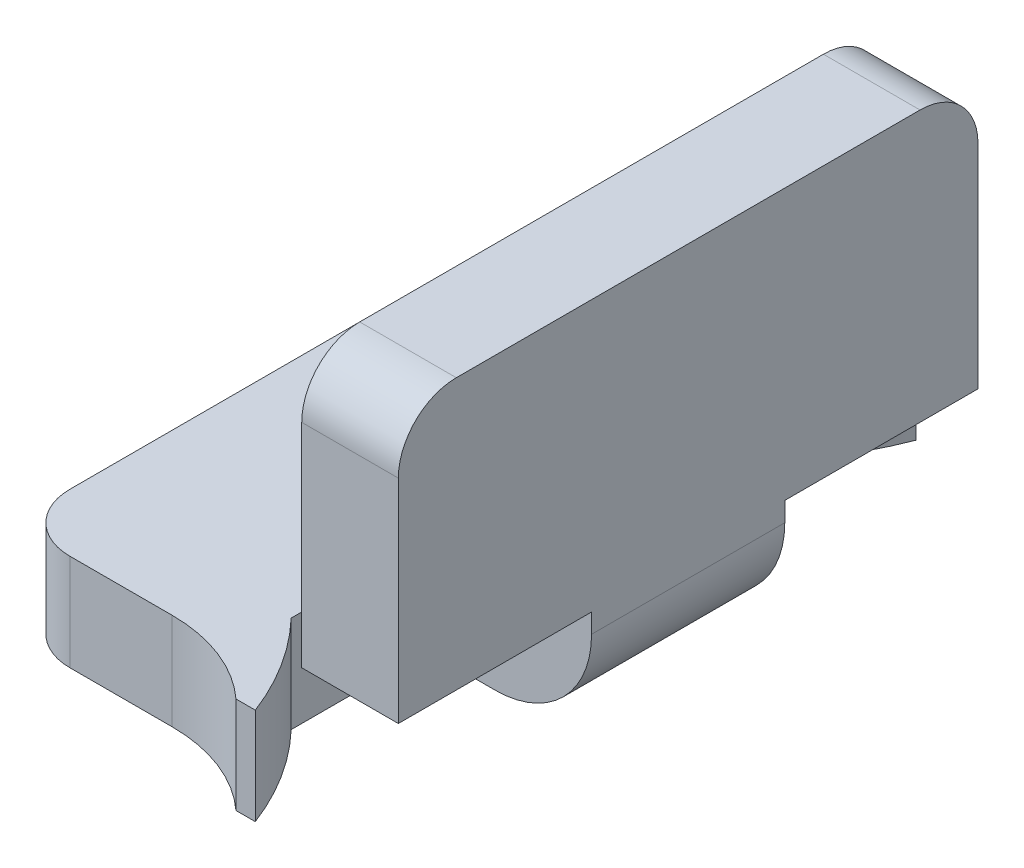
ISO-10303-21;
HEADER;
FILE_DESCRIPTION(('STEP AP214'),'2;1');
FILE_NAME('part.step','',(''),(''),'','','');
FILE_SCHEMA(('AUTOMOTIVE_DESIGN { 1 0 10303 214 1 1 1 1 }'));
ENDSEC;
DATA;
#1=APPLICATION_CONTEXT('core data for automotive mechanical design processes');
#2=APPLICATION_PROTOCOL_DEFINITION('international standard','automotive_design',2000,#1);
#3=PRODUCT_CONTEXT('',#1,'mechanical');
#4=PRODUCT('Part','Part','',(#3));
#5=PRODUCT_RELATED_PRODUCT_CATEGORY('part','',(#4));
#6=PRODUCT_DEFINITION_FORMATION('','',#4);
#7=PRODUCT_DEFINITION_CONTEXT('part definition',#1,'design');
#8=PRODUCT_DEFINITION('design','',#6,#7);
#9=PRODUCT_DEFINITION_SHAPE('','',#8);
#10=(LENGTH_UNIT() NAMED_UNIT(*) SI_UNIT(.MILLI.,.METRE.));
#11=(NAMED_UNIT(*) PLANE_ANGLE_UNIT() SI_UNIT($,.RADIAN.));
#12=(NAMED_UNIT(*) SI_UNIT($,.STERADIAN.) SOLID_ANGLE_UNIT());
#13=UNCERTAINTY_MEASURE_WITH_UNIT(LENGTH_MEASURE(1.E-05),#10,'distance_accuracy_value','');
#14=(GEOMETRIC_REPRESENTATION_CONTEXT(3) GLOBAL_UNCERTAINTY_ASSIGNED_CONTEXT((#13)) GLOBAL_UNIT_ASSIGNED_CONTEXT((#10,
#11,#12)) REPRESENTATION_CONTEXT('',''));
#15=CARTESIAN_POINT('',(0.,0.,0.));
#16=DIRECTION('',(0.,0.,1.));
#17=DIRECTION('',(1.,0.,0.));
#18=AXIS2_PLACEMENT_3D('',#15,#16,#17);
#19=CARTESIAN_POINT('',(-2.,0.5,1.5));
#20=DIRECTION('',(0.,-1.,0.));
#21=DIRECTION('',(1.,0.,0.));
#22=AXIS2_PLACEMENT_3D('',#19,#20,#21);
#23=PLANE('',#22);
#24=DIRECTION('',(1.,0.,0.));
#25=VECTOR('',#24,1.);
#26=CARTESIAN_POINT('',(-2.,0.5,-1.70998661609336));
#27=LINE('',#26,#25);
#28=CARTESIAN_POINT('',(-0.630209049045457,0.5,-1.70998661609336));
#29=VERTEX_POINT('',#28);
#30=CARTESIAN_POINT('',(-0.530209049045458,0.5,-1.70998661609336));
#31=VERTEX_POINT('',#30);
#32=EDGE_CURVE('E435',#29,#31,#27,.T.);
#33=ORIENTED_EDGE('',*,*,#32,.F.);
#34=CARTESIAN_POINT('',(-1.17047213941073,0.5,-2.3));
#35=DIRECTION('',(0.,1.,0.));
#36=DIRECTION('',(-1.,0.,0.));
#37=AXIS2_PLACEMENT_3D('',#34,#35,#36);
#38=CIRCLE('',#37,0.8);
#39=CARTESIAN_POINT('',(-1.17047213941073,0.5,-1.5));
#40=VERTEX_POINT('',#39);
#41=EDGE_CURVE('E436',#40,#29,#38,.T.);
#42=ORIENTED_EDGE('',*,*,#41,.F.);
#43=DIRECTION('',(-1.,0.,0.));
#44=VECTOR('',#43,1.);
#45=CARTESIAN_POINT('',(-0.6,0.5,-1.5));
#46=LINE('',#45,#44);
#47=CARTESIAN_POINT('',(-1.7,0.5,-1.5));
#48=VERTEX_POINT('',#47);
#49=EDGE_CURVE('E395',#48,#40,#46,.F.);
#50=ORIENTED_EDGE('',*,*,#49,.F.);
#51=CARTESIAN_POINT('',(-1.7,0.499999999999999,-1.2));
#52=DIRECTION('',(0.,1.,0.));
#53=DIRECTION('',(-1.,0.,0.));
#54=AXIS2_PLACEMENT_3D('',#51,#52,#53);
#55=CIRCLE('',#54,0.3);
#56=CARTESIAN_POINT('',(-2.,0.5,-1.2));
#57=VERTEX_POINT('',#56);
#58=EDGE_CURVE('E394',#57,#48,#55,.F.);
#59=ORIENTED_EDGE('',*,*,#58,.F.);
#60=DIRECTION('',(0.,0.,1.));
#61=VECTOR('',#60,1.);
#62=CARTESIAN_POINT('',(-2.,0.5,1.5));
#63=LINE('',#62,#61);
#64=CARTESIAN_POINT('',(-2.,0.500000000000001,1.2));
#65=VERTEX_POINT('',#64);
#66=EDGE_CURVE('E388',#57,#65,#63,.T.);
#67=ORIENTED_EDGE('',*,*,#66,.T.);
#68=CARTESIAN_POINT('',(-1.7,0.5,1.2));
#69=DIRECTION('',(0.,-1.,0.));
#70=DIRECTION('',(1.,0.,0.));
#71=AXIS2_PLACEMENT_3D('',#68,#69,#70);
#72=CIRCLE('',#71,0.3);
#73=CARTESIAN_POINT('',(-1.7,0.5,1.5));
#74=VERTEX_POINT('',#73);
#75=EDGE_CURVE('E439',#74,#65,#72,.T.);
#76=ORIENTED_EDGE('',*,*,#75,.F.);
#77=DIRECTION('',(1.,0.,0.));
#78=VECTOR('',#77,1.);
#79=CARTESIAN_POINT('',(-2.,0.5,1.5));
#80=LINE('',#79,#78);
#81=CARTESIAN_POINT('',(-1.17047213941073,0.5,1.5));
#82=VERTEX_POINT('',#81);
#83=EDGE_CURVE('E440',#82,#74,#80,.F.);
#84=ORIENTED_EDGE('',*,*,#83,.F.);
#85=CARTESIAN_POINT('',(-1.17047213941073,0.5,2.3));
#86=DIRECTION('',(0.,1.,0.));
#87=DIRECTION('',(-1.,0.,0.));
#88=AXIS2_PLACEMENT_3D('',#85,#86,#87);
#89=CIRCLE('',#88,0.8);
#90=CARTESIAN_POINT('',(-0.630209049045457,0.5,1.70998661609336));
#91=VERTEX_POINT('',#90);
#92=EDGE_CURVE('E441',#91,#82,#89,.T.);
#93=ORIENTED_EDGE('',*,*,#92,.F.);
#94=DIRECTION('',(1.,0.,0.));
#95=VECTOR('',#94,1.);
#96=CARTESIAN_POINT('',(-2.,0.5,1.70998661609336));
#97=LINE('',#96,#95);
#98=CARTESIAN_POINT('',(-0.530209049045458,0.5,1.70998661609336));
#99=VERTEX_POINT('',#98);
#100=EDGE_CURVE('E443',#99,#91,#97,.F.);
#101=ORIENTED_EDGE('',*,*,#100,.F.);
#102=CARTESIAN_POINT('',(-1.9321720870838,0.5,2.2433716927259));
#103=DIRECTION('',(0.,1.,0.));
#104=DIRECTION('',(-1.,0.,0.));
#105=AXIS2_PLACEMENT_3D('',#102,#103,#104);
#106=CIRCLE('',#105,1.5);
#107=CARTESIAN_POINT('',(-0.85,0.5,1.2046688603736));
#108=VERTEX_POINT('',#107);
#109=EDGE_CURVE('E21',#108,#99,#106,.F.);
#110=ORIENTED_EDGE('',*,*,#109,.F.);
#111=DIRECTION('',(0.,0.,1.));
#112=VECTOR('',#111,1.);
#113=CARTESIAN_POINT('',(-0.85,0.5,1.5));
#114=LINE('',#113,#112);
#115=CARTESIAN_POINT('',(-0.85,0.5,0.857037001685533));
#116=VERTEX_POINT('',#115);
#117=EDGE_CURVE('E169',#116,#108,#114,.T.);
#118=ORIENTED_EDGE('',*,*,#117,.F.);
#119=DIRECTION('',(-0.573576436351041,0.,0.819152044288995));
#120=VECTOR('',#119,1.);
#121=CARTESIAN_POINT('',(-0.6,0.5,0.5));
#122=LINE('',#121,#120);
#123=CARTESIAN_POINT('',(-0.6,0.5,0.5));
#124=VERTEX_POINT('',#123);
#125=EDGE_CURVE('E401',#124,#116,#122,.T.);
#126=ORIENTED_EDGE('',*,*,#125,.F.);
#127=DIRECTION('',(0.,0.,1.));
#128=VECTOR('',#127,1.);
#129=CARTESIAN_POINT('',(-0.6,0.5,1.5));
#130=LINE('',#129,#128);
#131=CARTESIAN_POINT('',(-0.6,0.5,-0.5));
#132=VERTEX_POINT('',#131);
#133=EDGE_CURVE('E181',#132,#124,#130,.T.);
#134=ORIENTED_EDGE('',*,*,#133,.F.);
#135=DIRECTION('',(0.573576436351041,0.,0.819152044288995));
#136=VECTOR('',#135,1.);
#137=CARTESIAN_POINT('',(-0.85,0.5,-0.857037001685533));
#138=LINE('',#137,#136);
#139=CARTESIAN_POINT('',(-0.85,0.5,-0.857037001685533));
#140=VERTEX_POINT('',#139);
#141=EDGE_CURVE('E175',#140,#132,#138,.T.);
#142=ORIENTED_EDGE('',*,*,#141,.F.);
#143=DIRECTION('',(0.,0.,1.));
#144=VECTOR('',#143,1.);
#145=CARTESIAN_POINT('',(-0.85,0.5,1.5));
#146=LINE('',#145,#144);
#147=CARTESIAN_POINT('',(-0.85,0.5,-1.2046688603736));
#148=VERTEX_POINT('',#147);
#149=EDGE_CURVE('E178',#148,#140,#146,.T.);
#150=ORIENTED_EDGE('',*,*,#149,.F.);
#151=CARTESIAN_POINT('',(-1.9321720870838,0.5,-2.2433716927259));
#152=DIRECTION('',(0.,1.,0.));
#153=DIRECTION('',(-1.,0.,0.));
#154=AXIS2_PLACEMENT_3D('',#151,#152,#153);
#155=CIRCLE('',#154,1.5);
#156=EDGE_CURVE('E398',#31,#148,#155,.F.);
#157=ORIENTED_EDGE('',*,*,#156,.F.);
#158=EDGE_LOOP('',(#33,#42,#50,#59,#67,#76,#84,#93,#101,#110,#118,#126,#134,#142,#150,#157));
#159=FACE_BOUND('',#158,.T.);
#160=ADVANCED_FACE('F17',(#159),#23,.F.);
#161=CARTESIAN_POINT('',(-0.6,0.6,-1.5));
#162=DIRECTION('',(0.,0.,-1.));
#163=DIRECTION('',(-1.,0.,0.));
#164=AXIS2_PLACEMENT_3D('',#161,#162,#163);
#165=PLANE('',#164);
#166=ORIENTED_EDGE('',*,*,#49,.T.);
#167=DIRECTION('',(0.,1.,0.));
#168=VECTOR('',#167,1.);
#169=CARTESIAN_POINT('',(-1.17047213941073,-0.81683038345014,-1.5));
#170=LINE('',#169,#168);
#171=CARTESIAN_POINT('',(-1.17047213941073,0.,-1.5));
#172=VERTEX_POINT('',#171);
#173=EDGE_CURVE('E362',#40,#172,#170,.F.);
#174=ORIENTED_EDGE('',*,*,#173,.T.);
#175=DIRECTION('',(1.,0.,0.));
#176=VECTOR('',#175,1.);
#177=CARTESIAN_POINT('',(-2.,0.,-1.5));
#178=LINE('',#177,#176);
#179=CARTESIAN_POINT('',(-1.7,0.,-1.5));
#180=VERTEX_POINT('',#179);
#181=EDGE_CURVE('E195',#172,#180,#178,.F.);
#182=ORIENTED_EDGE('',*,*,#181,.T.);
#183=DIRECTION('',(0.,1.,0.));
#184=VECTOR('',#183,1.);
#185=CARTESIAN_POINT('',(-1.7,0.499999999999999,-1.5));
#186=LINE('',#185,#184);
#187=EDGE_CURVE('E392',#48,#180,#186,.F.);
#188=ORIENTED_EDGE('',*,*,#187,.F.);
#189=EDGE_LOOP('',(#166,#174,#182,#188));
#190=FACE_BOUND('',#189,.T.);
#191=ADVANCED_FACE('F659',(#190),#165,.T.);
#192=CARTESIAN_POINT('',(-1.7,0.499999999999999,-1.2));
#193=DIRECTION('',(0.,1.,0.));
#194=DIRECTION('',(-1.,0.,0.));
#195=AXIS2_PLACEMENT_3D('',#192,#193,#194);
#196=CYLINDRICAL_SURFACE('',#195,0.3);
#197=CARTESIAN_POINT('',(-1.7,0.,-1.2));
#198=DIRECTION('',(0.,1.,0.));
#199=DIRECTION('',(-1.,0.,0.));
#200=AXIS2_PLACEMENT_3D('',#197,#198,#199);
#201=CIRCLE('',#200,0.3);
#202=CARTESIAN_POINT('',(-2.,0.,-1.2));
#203=VERTEX_POINT('',#202);
#204=EDGE_CURVE('E234',#180,#203,#201,.T.);
#205=ORIENTED_EDGE('',*,*,#204,.T.);
#206=DIRECTION('',(0.,1.,0.));
#207=VECTOR('',#206,1.);
#208=CARTESIAN_POINT('',(-2.,0.5,-1.2));
#209=LINE('',#208,#207);
#210=EDGE_CURVE('E389',#203,#57,#209,.T.);
#211=ORIENTED_EDGE('',*,*,#210,.T.);
#212=ORIENTED_EDGE('',*,*,#58,.T.);
#213=ORIENTED_EDGE('',*,*,#187,.T.);
#214=EDGE_LOOP('',(#205,#211,#212,#213));
#215=FACE_BOUND('',#214,.T.);
#216=ADVANCED_FACE('F651',(#215),#196,.T.);
#217=CARTESIAN_POINT('',(-2.,0.5,1.5));
#218=DIRECTION('',(1.,0.,0.));
#219=DIRECTION('',(0.,1.,0.));
#220=AXIS2_PLACEMENT_3D('',#217,#218,#219);
#221=PLANE('',#220);
#222=ORIENTED_EDGE('',*,*,#210,.F.);
#223=DIRECTION('',(0.,0.,1.));
#224=VECTOR('',#223,1.);
#225=CARTESIAN_POINT('',(-2.,0.,1.5));
#226=LINE('',#225,#224);
#227=CARTESIAN_POINT('',(-2.,0.,1.2));
#228=VERTEX_POINT('',#227);
#229=EDGE_CURVE('E231',#203,#228,#226,.T.);
#230=ORIENTED_EDGE('',*,*,#229,.T.);
#231=DIRECTION('',(0.,-1.,0.));
#232=VECTOR('',#231,1.);
#233=CARTESIAN_POINT('',(-2.,0.600000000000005,1.2));
#234=LINE('',#233,#232);
#235=EDGE_CURVE('E386',#65,#228,#234,.T.);
#236=ORIENTED_EDGE('',*,*,#235,.F.);
#237=ORIENTED_EDGE('',*,*,#66,.F.);
#238=EDGE_LOOP('',(#222,#230,#236,#237));
#239=FACE_BOUND('',#238,.T.);
#240=ADVANCED_FACE('F643',(#239),#221,.F.);
#241=CARTESIAN_POINT('',(-1.7,0.600000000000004,1.2));
#242=DIRECTION('',(0.,-1.,0.));
#243=DIRECTION('',(1.,0.,0.));
#244=AXIS2_PLACEMENT_3D('',#241,#242,#243);
#245=CYLINDRICAL_SURFACE('',#244,0.3);
#246=CARTESIAN_POINT('',(-1.7,0.,1.2));
#247=DIRECTION('',(0.,-1.,0.));
#248=DIRECTION('',(1.,0.,0.));
#249=AXIS2_PLACEMENT_3D('',#246,#247,#248);
#250=CIRCLE('',#249,0.3);
#251=CARTESIAN_POINT('',(-1.7,0.,1.5));
#252=VERTEX_POINT('',#251);
#253=EDGE_CURVE('E230',#228,#252,#250,.F.);
#254=ORIENTED_EDGE('',*,*,#253,.T.);
#255=DIRECTION('',(0.,1.,0.));
#256=VECTOR('',#255,1.);
#257=CARTESIAN_POINT('',(-1.7,0.6,1.5));
#258=LINE('',#257,#256);
#259=EDGE_CURVE('E383',#252,#74,#258,.T.);
#260=ORIENTED_EDGE('',*,*,#259,.T.);
#261=ORIENTED_EDGE('',*,*,#75,.T.);
#262=ORIENTED_EDGE('',*,*,#235,.T.);
#263=EDGE_LOOP('',(#254,#260,#261,#262));
#264=FACE_BOUND('',#263,.T.);
#265=ADVANCED_FACE('F635',(#264),#245,.T.);
#266=CARTESIAN_POINT('',(-0.6,0.6,1.5));
#267=DIRECTION('',(0.,0.,-1.));
#268=DIRECTION('',(-1.,0.,0.));
#269=AXIS2_PLACEMENT_3D('',#266,#267,#268);
#270=PLANE('',#269);
#271=ORIENTED_EDGE('',*,*,#259,.F.);
#272=DIRECTION('',(1.,0.,0.));
#273=VECTOR('',#272,1.);
#274=CARTESIAN_POINT('',(-2.,0.,1.5));
#275=LINE('',#274,#273);
#276=CARTESIAN_POINT('',(-1.17047213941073,0.,1.5));
#277=VERTEX_POINT('',#276);
#278=EDGE_CURVE('E227',#252,#277,#275,.T.);
#279=ORIENTED_EDGE('',*,*,#278,.T.);
#280=DIRECTION('',(0.,1.,0.));
#281=VECTOR('',#280,1.);
#282=CARTESIAN_POINT('',(-1.17047213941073,-0.81683038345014,1.5));
#283=LINE('',#282,#281);
#284=EDGE_CURVE('E380',#277,#82,#283,.T.);
#285=ORIENTED_EDGE('',*,*,#284,.T.);
#286=ORIENTED_EDGE('',*,*,#83,.T.);
#287=EDGE_LOOP('',(#271,#279,#285,#286));
#288=FACE_BOUND('',#287,.T.);
#289=ADVANCED_FACE('F628',(#288),#270,.F.);
#290=CARTESIAN_POINT('',(-1.17047213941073,-0.81683038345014,2.3));
#291=DIRECTION('',(0.,1.,0.));
#292=DIRECTION('',(-1.,0.,0.));
#293=AXIS2_PLACEMENT_3D('',#290,#291,#292);
#294=CYLINDRICAL_SURFACE('',#293,0.8);
#295=ORIENTED_EDGE('',*,*,#92,.T.);
#296=ORIENTED_EDGE('',*,*,#284,.F.);
#297=CARTESIAN_POINT('',(-1.17047213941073,0.,2.3));
#298=DIRECTION('',(0.,1.,0.));
#299=DIRECTION('',(-1.,0.,0.));
#300=AXIS2_PLACEMENT_3D('',#297,#298,#299);
#301=CIRCLE('',#300,0.8);
#302=CARTESIAN_POINT('',(-0.630209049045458,0.,1.70998661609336));
#303=VERTEX_POINT('',#302);
#304=EDGE_CURVE('E226',#277,#303,#301,.F.);
#305=ORIENTED_EDGE('',*,*,#304,.T.);
#306=DIRECTION('',(0.,1.,0.));
#307=VECTOR('',#306,1.);
#308=CARTESIAN_POINT('',(-0.630209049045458,0.,1.70998661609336));
#309=LINE('',#308,#307);
#310=EDGE_CURVE('E377',#303,#91,#309,.T.);
#311=ORIENTED_EDGE('',*,*,#310,.T.);
#312=EDGE_LOOP('',(#295,#296,#305,#311));
#313=FACE_BOUND('',#312,.T.);
#314=ADVANCED_FACE('F621',(#313),#294,.F.);
#315=CARTESIAN_POINT('',(-0.219038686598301,0.,1.70998661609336));
#316=DIRECTION('',(0.,0.,-1.));
#317=DIRECTION('',(-1.,0.,0.));
#318=AXIS2_PLACEMENT_3D('',#315,#316,#317);
#319=PLANE('',#318);
#320=DIRECTION('',(1.,0.,0.));
#321=VECTOR('',#320,1.);
#322=CARTESIAN_POINT('',(-2.,0.,1.70998661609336));
#323=LINE('',#322,#321);
#324=CARTESIAN_POINT('',(-0.530209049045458,0.,1.70998661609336));
#325=VERTEX_POINT('',#324);
#326=EDGE_CURVE('E223',#303,#325,#323,.T.);
#327=ORIENTED_EDGE('',*,*,#326,.T.);
#328=DIRECTION('',(0.,1.,0.));
#329=VECTOR('',#328,1.);
#330=CARTESIAN_POINT('',(-0.530209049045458,-0.81683038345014,1.70998661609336));
#331=LINE('',#330,#329);
#332=EDGE_CURVE('E371',#99,#325,#331,.F.);
#333=ORIENTED_EDGE('',*,*,#332,.F.);
#334=ORIENTED_EDGE('',*,*,#100,.T.);
#335=ORIENTED_EDGE('',*,*,#310,.F.);
#336=EDGE_LOOP('',(#327,#333,#334,#335));
#337=FACE_BOUND('',#336,.T.);
#338=ADVANCED_FACE('F613',(#337),#319,.F.);
#339=CARTESIAN_POINT('',(-1.9321720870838,-0.81683038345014,2.2433716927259));
#340=DIRECTION('',(0.,1.,0.));
#341=DIRECTION('',(-1.,0.,0.));
#342=AXIS2_PLACEMENT_3D('',#339,#340,#341);
#343=CYLINDRICAL_SURFACE('',#342,1.5);
#344=DIRECTION('',(0.,1.,0.));
#345=VECTOR('',#344,1.);
#346=CARTESIAN_POINT('',(-0.85,0.,1.2046688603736));
#347=LINE('',#346,#345);
#348=CARTESIAN_POINT('',(-0.85,0.,1.2046688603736));
#349=VERTEX_POINT('',#348);
#350=EDGE_CURVE('E196',#349,#108,#347,.T.);
#351=ORIENTED_EDGE('',*,*,#350,.T.);
#352=ORIENTED_EDGE('',*,*,#109,.T.);
#353=ORIENTED_EDGE('',*,*,#332,.T.);
#354=CARTESIAN_POINT('',(-1.9321720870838,0.,2.2433716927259));
#355=DIRECTION('',(0.,1.,0.));
#356=DIRECTION('',(-1.,0.,0.));
#357=AXIS2_PLACEMENT_3D('',#354,#355,#356);
#358=CIRCLE('',#357,1.5);
#359=EDGE_CURVE('E220',#325,#349,#358,.T.);
#360=ORIENTED_EDGE('',*,*,#359,.T.);
#361=EDGE_LOOP('',(#351,#352,#353,#360));
#362=FACE_BOUND('',#361,.T.);
#363=ADVANCED_FACE('F606',(#362),#343,.T.);
#364=CARTESIAN_POINT('',(-0.85,0.,-1.2046688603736));
#365=DIRECTION('',(1.,0.,0.));
#366=DIRECTION('',(0.,0.,-1.));
#367=AXIS2_PLACEMENT_3D('',#364,#365,#366);
#368=PLANE('',#367);
#369=DIRECTION('',(0.,0.,1.));
#370=VECTOR('',#369,1.);
#371=CARTESIAN_POINT('',(-0.85,0.,1.5));
#372=LINE('',#371,#370);
#373=CARTESIAN_POINT('',(-0.85,0.,-0.857037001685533));
#374=VERTEX_POINT('',#373);
#375=CARTESIAN_POINT('',(-0.85,0.,-1.2046688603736));
#376=VERTEX_POINT('',#375);
#377=EDGE_CURVE('E213',#374,#376,#372,.F.);
#378=ORIENTED_EDGE('',*,*,#377,.T.);
#379=DIRECTION('',(0.,1.,0.));
#380=VECTOR('',#379,1.);
#381=CARTESIAN_POINT('',(-0.85,-0.81683038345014,-1.2046688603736));
#382=LINE('',#381,#380);
#383=EDGE_CURVE('E199',#148,#376,#382,.F.);
#384=ORIENTED_EDGE('',*,*,#383,.F.);
#385=ORIENTED_EDGE('',*,*,#149,.T.);
#386=DIRECTION('',(0.,1.,0.));
#387=VECTOR('',#386,1.);
#388=CARTESIAN_POINT('',(-0.85,0.,-0.857037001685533));
#389=LINE('',#388,#387);
#390=EDGE_CURVE('E188',#374,#140,#389,.T.);
#391=ORIENTED_EDGE('',*,*,#390,.F.);
#392=EDGE_LOOP('',(#378,#384,#385,#391));
#393=FACE_BOUND('',#392,.T.);
#394=ADVANCED_FACE('F198',(#393),#368,.T.);
#395=CARTESIAN_POINT('',(-1.9321720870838,-0.81683038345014,-2.2433716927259));
#396=DIRECTION('',(0.,1.,0.));
#397=DIRECTION('',(-1.,0.,0.));
#398=AXIS2_PLACEMENT_3D('',#395,#396,#397);
#399=CYLINDRICAL_SURFACE('',#398,1.5);
#400=ORIENTED_EDGE('',*,*,#383,.T.);
#401=CARTESIAN_POINT('',(-1.9321720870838,0.,-2.2433716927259));
#402=DIRECTION('',(0.,1.,0.));
#403=DIRECTION('',(-1.,0.,0.));
#404=AXIS2_PLACEMENT_3D('',#401,#402,#403);
#405=CIRCLE('',#404,1.5);
#406=CARTESIAN_POINT('',(-0.530209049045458,0.,-1.70998661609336));
#407=VERTEX_POINT('',#406);
#408=EDGE_CURVE('E212',#376,#407,#405,.T.);
#409=ORIENTED_EDGE('',*,*,#408,.T.);
#410=DIRECTION('',(0.,1.,0.));
#411=VECTOR('',#410,1.);
#412=CARTESIAN_POINT('',(-0.530209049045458,0.,-1.70998661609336));
#413=LINE('',#412,#411);
#414=EDGE_CURVE('E366',#407,#31,#413,.T.);
#415=ORIENTED_EDGE('',*,*,#414,.T.);
#416=ORIENTED_EDGE('',*,*,#156,.T.);
#417=EDGE_LOOP('',(#400,#409,#415,#416));
#418=FACE_BOUND('',#417,.T.);
#419=ADVANCED_FACE('F591',(#418),#399,.T.);
#420=CARTESIAN_POINT('',(-0.219038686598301,0.,-1.70998661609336));
#421=DIRECTION('',(0.,0.,1.));
#422=DIRECTION('',(1.,0.,0.));
#423=AXIS2_PLACEMENT_3D('',#420,#421,#422);
#424=PLANE('',#423);
#425=ORIENTED_EDGE('',*,*,#32,.T.);
#426=ORIENTED_EDGE('',*,*,#414,.F.);
#427=DIRECTION('',(1.,0.,0.));
#428=VECTOR('',#427,1.);
#429=CARTESIAN_POINT('',(-2.,0.,-1.70998661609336));
#430=LINE('',#429,#428);
#431=CARTESIAN_POINT('',(-0.630209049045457,0.,-1.70998661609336));
#432=VERTEX_POINT('',#431);
#433=EDGE_CURVE('E208',#407,#432,#430,.F.);
#434=ORIENTED_EDGE('',*,*,#433,.T.);
#435=DIRECTION('',(0.,1.,0.));
#436=VECTOR('',#435,1.);
#437=CARTESIAN_POINT('',(-0.630209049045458,-0.81683038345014,-1.70998661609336));
#438=LINE('',#437,#436);
#439=EDGE_CURVE('E365',#432,#29,#438,.T.);
#440=ORIENTED_EDGE('',*,*,#439,.T.);
#441=EDGE_LOOP('',(#425,#426,#434,#440));
#442=FACE_BOUND('',#441,.T.);
#443=ADVANCED_FACE('F583',(#442),#424,.F.);
#444=CARTESIAN_POINT('',(-1.17047213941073,-0.81683038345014,-2.3));
#445=DIRECTION('',(0.,1.,0.));
#446=DIRECTION('',(-1.,0.,0.));
#447=AXIS2_PLACEMENT_3D('',#444,#445,#446);
#448=CYLINDRICAL_SURFACE('',#447,0.8);
#449=CARTESIAN_POINT('',(-1.17047213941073,0.,-2.3));
#450=DIRECTION('',(0.,1.,0.));
#451=DIRECTION('',(-1.,0.,0.));
#452=AXIS2_PLACEMENT_3D('',#449,#450,#451);
#453=CIRCLE('',#452,0.8);
#454=EDGE_CURVE('E211',#432,#172,#453,.F.);
#455=ORIENTED_EDGE('',*,*,#454,.T.);
#456=ORIENTED_EDGE('',*,*,#173,.F.);
#457=ORIENTED_EDGE('',*,*,#41,.T.);
#458=ORIENTED_EDGE('',*,*,#439,.F.);
#459=EDGE_LOOP('',(#455,#456,#457,#458));
#460=FACE_BOUND('',#459,.T.);
#461=ADVANCED_FACE('F576',(#460),#448,.F.);
#462=CARTESIAN_POINT('',(-0.85,0.,1.2046688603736));
#463=DIRECTION('',(-1.,0.,0.));
#464=DIRECTION('',(0.,0.,1.));
#465=AXIS2_PLACEMENT_3D('',#462,#463,#464);
#466=PLANE('',#465);
#467=ORIENTED_EDGE('',*,*,#350,.F.);
#468=DIRECTION('',(0.,0.,1.));
#469=VECTOR('',#468,1.);
#470=CARTESIAN_POINT('',(-0.85,0.,1.5));
#471=LINE('',#470,#469);
#472=CARTESIAN_POINT('',(-0.85,0.,0.857037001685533));
#473=VERTEX_POINT('',#472);
#474=EDGE_CURVE('E217',#349,#473,#471,.F.);
#475=ORIENTED_EDGE('',*,*,#474,.T.);
#476=DIRECTION('',(0.,1.,0.));
#477=VECTOR('',#476,1.);
#478=CARTESIAN_POINT('',(-0.85,0.,0.857037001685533));
#479=LINE('',#478,#477);
#480=EDGE_CURVE('E341',#473,#116,#479,.T.);
#481=ORIENTED_EDGE('',*,*,#480,.T.);
#482=ORIENTED_EDGE('',*,*,#117,.T.);
#483=EDGE_LOOP('',(#467,#475,#481,#482));
#484=FACE_BOUND('',#483,.T.);
#485=ADVANCED_FACE('F453',(#484),#466,.F.);
#486=CARTESIAN_POINT('',(-0.85,0.,-0.857037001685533));
#487=DIRECTION('',(0.819152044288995,0.,-0.573576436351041));
#488=DIRECTION('',(-0.573576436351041,0.,-0.819152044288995));
#489=AXIS2_PLACEMENT_3D('',#486,#487,#488);
#490=PLANE('',#489);
#491=DIRECTION('',(-0.573576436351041,0.,-0.819152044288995));
#492=VECTOR('',#491,1.);
#493=CARTESIAN_POINT('',(-0.6,0.,-0.5));
#494=LINE('',#493,#492);
#495=CARTESIAN_POINT('',(-0.6,0.,-0.5));
#496=VERTEX_POINT('',#495);
#497=EDGE_CURVE('E191',#496,#374,#494,.T.);
#498=ORIENTED_EDGE('',*,*,#497,.T.);
#499=ORIENTED_EDGE('',*,*,#390,.T.);
#500=ORIENTED_EDGE('',*,*,#141,.T.);
#501=DIRECTION('',(0.,1.,0.));
#502=VECTOR('',#501,1.);
#503=CARTESIAN_POINT('',(-0.6,0.6,-0.5));
#504=LINE('',#503,#502);
#505=EDGE_CURVE('E246',#132,#496,#504,.F.);
#506=ORIENTED_EDGE('',*,*,#505,.T.);
#507=EDGE_LOOP('',(#498,#499,#500,#506));
#508=FACE_BOUND('',#507,.T.);
#509=ADVANCED_FACE('F189',(#508),#490,.T.);
#510=CARTESIAN_POINT('',(-2.,0.,1.5));
#511=DIRECTION('',(0.,1.,0.));
#512=DIRECTION('',(0.,0.,1.));
#513=AXIS2_PLACEMENT_3D('',#510,#511,#512);
#514=PLANE('',#513);
#515=ORIENTED_EDGE('',*,*,#433,.F.);
#516=ORIENTED_EDGE('',*,*,#408,.F.);
#517=ORIENTED_EDGE('',*,*,#377,.F.);
#518=ORIENTED_EDGE('',*,*,#497,.F.);
#519=DIRECTION('',(1.,0.,0.));
#520=VECTOR('',#519,1.);
#521=CARTESIAN_POINT('',(0.,0.,-0.5));
#522=LINE('',#521,#520);
#523=CARTESIAN_POINT('',(-0.5,0.,-0.5));
#524=VERTEX_POINT('',#523);
#525=EDGE_CURVE('E241',#496,#524,#522,.T.);
#526=ORIENTED_EDGE('',*,*,#525,.T.);
#527=DIRECTION('',(0.,0.,-1.));
#528=VECTOR('',#527,1.);
#529=CARTESIAN_POINT('',(-0.5,0.,1.5));
#530=LINE('',#529,#528);
#531=CARTESIAN_POINT('',(-0.5,0.,0.5));
#532=VERTEX_POINT('',#531);
#533=EDGE_CURVE('E240',#532,#524,#530,.T.);
#534=ORIENTED_EDGE('',*,*,#533,.F.);
#535=DIRECTION('',(-1.,0.,0.));
#536=VECTOR('',#535,1.);
#537=CARTESIAN_POINT('',(0.,0.,0.5));
#538=LINE('',#537,#536);
#539=CARTESIAN_POINT('',(-0.6,0.,0.5));
#540=VERTEX_POINT('',#539);
#541=EDGE_CURVE('E257',#532,#540,#538,.T.);
#542=ORIENTED_EDGE('',*,*,#541,.T.);
#543=DIRECTION('',(-0.573576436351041,0.,0.819152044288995));
#544=VECTOR('',#543,1.);
#545=CARTESIAN_POINT('',(-0.85,0.,0.857037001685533));
#546=LINE('',#545,#544);
#547=EDGE_CURVE('E342',#540,#473,#546,.T.);
#548=ORIENTED_EDGE('',*,*,#547,.T.);
#549=ORIENTED_EDGE('',*,*,#474,.F.);
#550=ORIENTED_EDGE('',*,*,#359,.F.);
#551=ORIENTED_EDGE('',*,*,#326,.F.);
#552=ORIENTED_EDGE('',*,*,#304,.F.);
#553=ORIENTED_EDGE('',*,*,#278,.F.);
#554=ORIENTED_EDGE('',*,*,#253,.F.);
#555=ORIENTED_EDGE('',*,*,#229,.F.);
#556=ORIENTED_EDGE('',*,*,#204,.F.);
#557=ORIENTED_EDGE('',*,*,#181,.F.);
#558=ORIENTED_EDGE('',*,*,#454,.F.);
#559=EDGE_LOOP('',(#515,#516,#517,#518,#526,#534,#542,#548,#549,#550,#551,#552,#553,#554,#555,
#556,#557,#558));
#560=FACE_BOUND('',#559,.T.);
#561=ADVANCED_FACE('F511',(#560),#514,.F.);
#562=CARTESIAN_POINT('',(-0.85,0.,0.857037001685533));
#563=DIRECTION('',(-0.819152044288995,0.,-0.573576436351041));
#564=DIRECTION('',(-0.573576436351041,0.,0.819152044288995));
#565=AXIS2_PLACEMENT_3D('',#562,#563,#564);
#566=PLANE('',#565);
#567=ORIENTED_EDGE('',*,*,#480,.F.);
#568=ORIENTED_EDGE('',*,*,#547,.F.);
#569=DIRECTION('',(0.,1.,0.));
#570=VECTOR('',#569,1.);
#571=CARTESIAN_POINT('',(-0.6,0.6,0.5));
#572=LINE('',#571,#570);
#573=EDGE_CURVE('E253',#540,#124,#572,.T.);
#574=ORIENTED_EDGE('',*,*,#573,.T.);
#575=ORIENTED_EDGE('',*,*,#125,.T.);
#576=EDGE_LOOP('',(#567,#568,#574,#575));
#577=FACE_BOUND('',#576,.T.);
#578=ADVANCED_FACE('F458',(#577),#566,.F.);
#579=CARTESIAN_POINT('',(-0.6,0.6,1.5));
#580=DIRECTION('',(0.,0.,-1.));
#581=DIRECTION('',(-1.,0.,0.));
#582=AXIS2_PLACEMENT_3D('',#579,#580,#581);
#583=CYLINDRICAL_SURFACE('',#582,0.1);
#584=CARTESIAN_POINT('',(-0.6,0.6,-0.5));
#585=DIRECTION('',(0.,0.,-1.));
#586=DIRECTION('',(-1.,0.,0.));
#587=AXIS2_PLACEMENT_3D('',#584,#585,#586);
#588=CIRCLE('',#587,0.1);
#589=CARTESIAN_POINT('',(-0.5,0.6,-0.5));
#590=VERTEX_POINT('',#589);
#591=EDGE_CURVE('E250',#590,#132,#588,.T.);
#592=ORIENTED_EDGE('',*,*,#591,.T.);
#593=ORIENTED_EDGE('',*,*,#133,.T.);
#594=CARTESIAN_POINT('',(-0.6,0.6,0.5));
#595=DIRECTION('',(0.,0.,-1.));
#596=DIRECTION('',(-1.,0.,0.));
#597=AXIS2_PLACEMENT_3D('',#594,#595,#596);
#598=CIRCLE('',#597,0.1);
#599=CARTESIAN_POINT('',(-0.5,0.6,0.5));
#600=VERTEX_POINT('',#599);
#601=EDGE_CURVE('E256',#124,#600,#598,.F.);
#602=ORIENTED_EDGE('',*,*,#601,.T.);
#603=DIRECTION('',(0.,0.,1.));
#604=VECTOR('',#603,1.);
#605=CARTESIAN_POINT('',(-0.5,0.6,1.5));
#606=LINE('',#605,#604);
#607=EDGE_CURVE('E338',#600,#590,#606,.F.);
#608=ORIENTED_EDGE('',*,*,#607,.T.);
#609=EDGE_LOOP('',(#592,#593,#602,#608));
#610=FACE_BOUND('',#609,.T.);
#611=ADVANCED_FACE('F466',(#610),#583,.F.);
#612=CARTESIAN_POINT('',(-0.5,2.,1.5));
#613=DIRECTION('',(1.,0.,0.));
#614=DIRECTION('',(0.,1.,0.));
#615=AXIS2_PLACEMENT_3D('',#612,#613,#614);
#616=PLANE('',#615);
#617=CARTESIAN_POINT('',(-0.499999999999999,1.7,1.2));
#618=DIRECTION('',(-1.,0.,0.));
#619=DIRECTION('',(0.,-1.,0.));
#620=AXIS2_PLACEMENT_3D('',#617,#618,#619);
#621=CIRCLE('',#620,0.3);
#622=CARTESIAN_POINT('',(-0.5,2.,1.2));
#623=VERTEX_POINT('',#622);
#624=CARTESIAN_POINT('',(-0.5,1.7,1.5));
#625=VERTEX_POINT('',#624);
#626=EDGE_CURVE('E285',#623,#625,#621,.F.);
#627=ORIENTED_EDGE('',*,*,#626,.F.);
#628=DIRECTION('',(0.,0.,1.));
#629=VECTOR('',#628,1.);
#630=CARTESIAN_POINT('',(-0.5,2.,1.5));
#631=LINE('',#630,#629);
#632=CARTESIAN_POINT('',(-0.500000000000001,2.,-1.2));
#633=VERTEX_POINT('',#632);
#634=EDGE_CURVE('E279',#623,#633,#631,.F.);
#635=ORIENTED_EDGE('',*,*,#634,.T.);
#636=CARTESIAN_POINT('',(-0.5,1.7,-1.2));
#637=DIRECTION('',(1.,0.,0.));
#638=DIRECTION('',(0.,1.,0.));
#639=AXIS2_PLACEMENT_3D('',#636,#637,#638);
#640=CIRCLE('',#639,0.3);
#641=CARTESIAN_POINT('',(-0.5,1.7,-1.5));
#642=VERTEX_POINT('',#641);
#643=EDGE_CURVE('E340',#642,#633,#640,.T.);
#644=ORIENTED_EDGE('',*,*,#643,.F.);
#645=DIRECTION('',(0.,1.,0.));
#646=VECTOR('',#645,1.);
#647=CARTESIAN_POINT('',(-0.5,0.6,-1.5));
#648=LINE('',#647,#646);
#649=CARTESIAN_POINT('',(-0.5,0.6,-1.5));
#650=VERTEX_POINT('',#649);
#651=EDGE_CURVE('E327',#650,#642,#648,.T.);
#652=ORIENTED_EDGE('',*,*,#651,.F.);
#653=DIRECTION('',(0.,0.,1.));
#654=VECTOR('',#653,1.);
#655=CARTESIAN_POINT('',(-0.5,0.6,-1.5));
#656=LINE('',#655,#654);
#657=EDGE_CURVE('E322',#650,#590,#656,.T.);
#658=ORIENTED_EDGE('',*,*,#657,.T.);
#659=ORIENTED_EDGE('',*,*,#607,.F.);
#660=DIRECTION('',(0.,0.,1.));
#661=VECTOR('',#660,1.);
#662=CARTESIAN_POINT('',(-0.5,0.6,1.5));
#663=LINE('',#662,#661);
#664=CARTESIAN_POINT('',(-0.5,0.600000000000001,1.5));
#665=VERTEX_POINT('',#664);
#666=EDGE_CURVE('E300',#600,#665,#663,.T.);
#667=ORIENTED_EDGE('',*,*,#666,.T.);
#668=DIRECTION('',(0.,1.,0.));
#669=VECTOR('',#668,1.);
#670=CARTESIAN_POINT('',(-0.5,0.6,1.5));
#671=LINE('',#670,#669);
#672=EDGE_CURVE('E289',#665,#625,#671,.T.);
#673=ORIENTED_EDGE('',*,*,#672,.T.);
#674=EDGE_LOOP('',(#627,#635,#644,#652,#658,#659,#667,#673));
#675=FACE_BOUND('',#674,.T.);
#676=ADVANCED_FACE('F499',(#675),#616,.F.);
#677=CARTESIAN_POINT('',(-0.499999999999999,1.7,-1.2));
#678=DIRECTION('',(1.,0.,0.));
#679=DIRECTION('',(0.,1.,0.));
#680=AXIS2_PLACEMENT_3D('',#677,#678,#679);
#681=CYLINDRICAL_SURFACE('',#680,0.3);
#682=ORIENTED_EDGE('',*,*,#643,.T.);
#683=DIRECTION('',(1.,0.,0.));
#684=VECTOR('',#683,1.);
#685=CARTESIAN_POINT('',(-0.5,2.,-1.2));
#686=LINE('',#685,#684);
#687=CARTESIAN_POINT('',(0.,2.,-1.2));
#688=VERTEX_POINT('',#687);
#689=EDGE_CURVE('E280',#633,#688,#686,.T.);
#690=ORIENTED_EDGE('',*,*,#689,.T.);
#691=CARTESIAN_POINT('',(0.,1.7,-1.2));
#692=DIRECTION('',(1.,0.,0.));
#693=DIRECTION('',(0.,1.,0.));
#694=AXIS2_PLACEMENT_3D('',#691,#692,#693);
#695=CIRCLE('',#694,0.3);
#696=CARTESIAN_POINT('',(0.,1.7,-1.5));
#697=VERTEX_POINT('',#696);
#698=EDGE_CURVE('E275',#688,#697,#695,.F.);
#699=ORIENTED_EDGE('',*,*,#698,.T.);
#700=DIRECTION('',(-1.,0.,0.));
#701=VECTOR('',#700,1.);
#702=CARTESIAN_POINT('',(-0.6,1.7,-1.5));
#703=LINE('',#702,#701);
#704=EDGE_CURVE('E325',#642,#697,#703,.F.);
#705=ORIENTED_EDGE('',*,*,#704,.F.);
#706=EDGE_LOOP('',(#682,#690,#699,#705));
#707=FACE_BOUND('',#706,.T.);
#708=ADVANCED_FACE('F553',(#707),#681,.T.);
#709=CARTESIAN_POINT('',(-0.6,0.6,-1.5));
#710=DIRECTION('',(0.,0.,-1.));
#711=DIRECTION('',(-1.,0.,0.));
#712=AXIS2_PLACEMENT_3D('',#709,#710,#711);
#713=PLANE('',#712);
#714=DIRECTION('',(0.,-1.,0.));
#715=VECTOR('',#714,1.);
#716=CARTESIAN_POINT('',(0.,2.,-1.5));
#717=LINE('',#716,#715);
#718=CARTESIAN_POINT('',(0.,0.6,-1.5));
#719=VERTEX_POINT('',#718);
#720=EDGE_CURVE('E271',#697,#719,#717,.T.);
#721=ORIENTED_EDGE('',*,*,#720,.T.);
#722=DIRECTION('',(-1.,0.,0.));
#723=VECTOR('',#722,1.);
#724=CARTESIAN_POINT('',(0.,0.6,-1.5));
#725=LINE('',#724,#723);
#726=EDGE_CURVE('E319',#719,#650,#725,.T.);
#727=ORIENTED_EDGE('',*,*,#726,.T.);
#728=ORIENTED_EDGE('',*,*,#651,.T.);
#729=ORIENTED_EDGE('',*,*,#704,.T.);
#730=EDGE_LOOP('',(#721,#727,#728,#729));
#731=FACE_BOUND('',#730,.T.);
#732=ADVANCED_FACE('F550',(#731),#713,.T.);
#733=CARTESIAN_POINT('',(0.,0.6,-1.5));
#734=DIRECTION('',(0.,1.,0.));
#735=DIRECTION('',(-1.,0.,0.));
#736=AXIS2_PLACEMENT_3D('',#733,#734,#735);
#737=PLANE('',#736);
#738=DIRECTION('',(0.,0.,1.));
#739=VECTOR('',#738,1.);
#740=CARTESIAN_POINT('',(0.,0.6,1.5));
#741=LINE('',#740,#739);
#742=CARTESIAN_POINT('',(0.,0.6,-0.5));
#743=VERTEX_POINT('',#742);
#744=EDGE_CURVE('E274',#719,#743,#741,.T.);
#745=ORIENTED_EDGE('',*,*,#744,.T.);
#746=DIRECTION('',(1.,0.,0.));
#747=VECTOR('',#746,1.);
#748=CARTESIAN_POINT('',(0.,0.6,-0.5));
#749=LINE('',#748,#747);
#750=EDGE_CURVE('E237',#743,#590,#749,.F.);
#751=ORIENTED_EDGE('',*,*,#750,.T.);
#752=ORIENTED_EDGE('',*,*,#657,.F.);
#753=ORIENTED_EDGE('',*,*,#726,.F.);
#754=EDGE_LOOP('',(#745,#751,#752,#753));
#755=FACE_BOUND('',#754,.T.);
#756=ADVANCED_FACE('F503',(#755),#737,.F.);
#757=CARTESIAN_POINT('',(0.,0.6,-0.5));
#758=DIRECTION('',(0.,0.,1.));
#759=DIRECTION('',(1.,0.,0.));
#760=AXIS2_PLACEMENT_3D('',#757,#758,#759);
#761=PLANE('',#760);
#762=DIRECTION('',(0.,-1.,0.));
#763=VECTOR('',#762,1.);
#764=CARTESIAN_POINT('',(0.,2.,-0.5));
#765=LINE('',#764,#763);
#766=CARTESIAN_POINT('',(0.,0.499999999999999,-0.5));
#767=VERTEX_POINT('',#766);
#768=EDGE_CURVE('E310',#743,#767,#765,.T.);
#769=ORIENTED_EDGE('',*,*,#768,.T.);
#770=CARTESIAN_POINT('',(-0.5,0.5,-0.5));
#771=DIRECTION('',(0.,0.,-1.));
#772=DIRECTION('',(-1.,0.,0.));
#773=AXIS2_PLACEMENT_3D('',#770,#771,#772);
#774=CIRCLE('',#773,0.5);
#775=EDGE_CURVE('E348',#524,#767,#774,.F.);
#776=ORIENTED_EDGE('',*,*,#775,.F.);
#777=ORIENTED_EDGE('',*,*,#525,.F.);
#778=ORIENTED_EDGE('',*,*,#505,.F.);
#779=ORIENTED_EDGE('',*,*,#591,.F.);
#780=ORIENTED_EDGE('',*,*,#750,.F.);
#781=EDGE_LOOP('',(#769,#776,#777,#778,#779,#780));
#782=FACE_BOUND('',#781,.T.);
#783=ADVANCED_FACE('F472',(#782),#761,.F.);
#784=CARTESIAN_POINT('',(-0.5,0.5,1.5));
#785=DIRECTION('',(0.,0.,-1.));
#786=DIRECTION('',(-1.,0.,0.));
#787=AXIS2_PLACEMENT_3D('',#784,#785,#786);
#788=CYLINDRICAL_SURFACE('',#787,0.5);
#789=ORIENTED_EDGE('',*,*,#533,.T.);
#790=ORIENTED_EDGE('',*,*,#775,.T.);
#791=DIRECTION('',(0.,0.,1.));
#792=VECTOR('',#791,1.);
#793=CARTESIAN_POINT('',(0.,0.5,1.5));
#794=LINE('',#793,#792);
#795=CARTESIAN_POINT('',(0.,0.499999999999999,0.5));
#796=VERTEX_POINT('',#795);
#797=EDGE_CURVE('E305',#767,#796,#794,.T.);
#798=ORIENTED_EDGE('',*,*,#797,.T.);
#799=CARTESIAN_POINT('',(-0.5,0.5,0.5));
#800=DIRECTION('',(0.,0.,-1.));
#801=DIRECTION('',(-1.,0.,0.));
#802=AXIS2_PLACEMENT_3D('',#799,#800,#801);
#803=CIRCLE('',#802,0.5);
#804=EDGE_CURVE('E262',#796,#532,#803,.T.);
#805=ORIENTED_EDGE('',*,*,#804,.T.);
#806=EDGE_LOOP('',(#789,#790,#798,#805));
#807=FACE_BOUND('',#806,.T.);
#808=ADVANCED_FACE('F509',(#807),#788,.T.);
#809=CARTESIAN_POINT('',(0.,0.6,0.5));
#810=DIRECTION('',(0.,0.,-1.));
#811=DIRECTION('',(-1.,0.,0.));
#812=AXIS2_PLACEMENT_3D('',#809,#810,#811);
#813=PLANE('',#812);
#814=ORIENTED_EDGE('',*,*,#573,.F.);
#815=ORIENTED_EDGE('',*,*,#541,.F.);
#816=ORIENTED_EDGE('',*,*,#804,.F.);
#817=DIRECTION('',(0.,-1.,0.));
#818=VECTOR('',#817,1.);
#819=CARTESIAN_POINT('',(0.,2.,0.5));
#820=LINE('',#819,#818);
#821=CARTESIAN_POINT('',(0.,0.6,0.5));
#822=VERTEX_POINT('',#821);
#823=EDGE_CURVE('E295',#796,#822,#820,.F.);
#824=ORIENTED_EDGE('',*,*,#823,.T.);
#825=DIRECTION('',(-1.,0.,0.));
#826=VECTOR('',#825,1.);
#827=CARTESIAN_POINT('',(0.,0.6,0.5));
#828=LINE('',#827,#826);
#829=EDGE_CURVE('E290',#822,#600,#828,.T.);
#830=ORIENTED_EDGE('',*,*,#829,.T.);
#831=ORIENTED_EDGE('',*,*,#601,.F.);
#832=EDGE_LOOP('',(#814,#815,#816,#824,#830,#831));
#833=FACE_BOUND('',#832,.T.);
#834=ADVANCED_FACE('F463',(#833),#813,.F.);
#835=CARTESIAN_POINT('',(0.,0.600000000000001,1.5));
#836=DIRECTION('',(0.,1.,0.));
#837=DIRECTION('',(-1.,0.,0.));
#838=AXIS2_PLACEMENT_3D('',#835,#836,#837);
#839=PLANE('',#838);
#840=DIRECTION('',(0.,0.,1.));
#841=VECTOR('',#840,1.);
#842=CARTESIAN_POINT('',(0.,0.6,1.5));
#843=LINE('',#842,#841);
#844=CARTESIAN_POINT('',(0.,0.6,1.5));
#845=VERTEX_POINT('',#844);
#846=EDGE_CURVE('E268',#822,#845,#843,.T.);
#847=ORIENTED_EDGE('',*,*,#846,.T.);
#848=DIRECTION('',(-1.,0.,0.));
#849=VECTOR('',#848,1.);
#850=CARTESIAN_POINT('',(-0.6,0.600000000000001,1.5));
#851=LINE('',#850,#849);
#852=EDGE_CURVE('E286',#845,#665,#851,.T.);
#853=ORIENTED_EDGE('',*,*,#852,.T.);
#854=ORIENTED_EDGE('',*,*,#666,.F.);
#855=ORIENTED_EDGE('',*,*,#829,.F.);
#856=EDGE_LOOP('',(#847,#853,#854,#855));
#857=FACE_BOUND('',#856,.T.);
#858=ADVANCED_FACE('F497',(#857),#839,.F.);
#859=CARTESIAN_POINT('',(-0.6,0.6,1.5));
#860=DIRECTION('',(0.,0.,-1.));
#861=DIRECTION('',(-1.,0.,0.));
#862=AXIS2_PLACEMENT_3D('',#859,#860,#861);
#863=PLANE('',#862);
#864=DIRECTION('',(-1.,0.,0.));
#865=VECTOR('',#864,1.);
#866=CARTESIAN_POINT('',(-0.600000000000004,1.7,1.5));
#867=LINE('',#866,#865);
#868=CARTESIAN_POINT('',(0.,1.7,1.5));
#869=VERTEX_POINT('',#868);
#870=EDGE_CURVE('E283',#625,#869,#867,.F.);
#871=ORIENTED_EDGE('',*,*,#870,.F.);
#872=ORIENTED_EDGE('',*,*,#672,.F.);
#873=ORIENTED_EDGE('',*,*,#852,.F.);
#874=DIRECTION('',(0.,-1.,0.));
#875=VECTOR('',#874,1.);
#876=CARTESIAN_POINT('',(0.,2.,1.5));
#877=LINE('',#876,#875);
#878=EDGE_CURVE('E265',#845,#869,#877,.F.);
#879=ORIENTED_EDGE('',*,*,#878,.T.);
#880=EDGE_LOOP('',(#871,#872,#873,#879));
#881=FACE_BOUND('',#880,.T.);
#882=ADVANCED_FACE('F490',(#881),#863,.F.);
#883=CARTESIAN_POINT('',(-0.600000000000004,1.7,1.2));
#884=DIRECTION('',(-1.,0.,0.));
#885=DIRECTION('',(0.,-1.,0.));
#886=AXIS2_PLACEMENT_3D('',#883,#884,#885);
#887=CYLINDRICAL_SURFACE('',#886,0.3);
#888=ORIENTED_EDGE('',*,*,#626,.T.);
#889=ORIENTED_EDGE('',*,*,#870,.T.);
#890=CARTESIAN_POINT('',(0.,1.7,1.2));
#891=DIRECTION('',(-1.,0.,0.));
#892=DIRECTION('',(0.,-1.,0.));
#893=AXIS2_PLACEMENT_3D('',#890,#891,#892);
#894=CIRCLE('',#893,0.3);
#895=CARTESIAN_POINT('',(0.,2.,1.2));
#896=VERTEX_POINT('',#895);
#897=EDGE_CURVE('E27',#869,#896,#894,.T.);
#898=ORIENTED_EDGE('',*,*,#897,.T.);
#899=DIRECTION('',(1.,0.,0.));
#900=VECTOR('',#899,1.);
#901=CARTESIAN_POINT('',(-0.5,2.,1.2));
#902=LINE('',#901,#900);
#903=EDGE_CURVE('E35',#896,#623,#902,.F.);
#904=ORIENTED_EDGE('',*,*,#903,.T.);
#905=EDGE_LOOP('',(#888,#889,#898,#904));
#906=FACE_BOUND('',#905,.T.);
#907=ADVANCED_FACE('F530',(#906),#887,.T.);
#908=CARTESIAN_POINT('',(-0.5,2.,1.5));
#909=DIRECTION('',(0.,-1.,0.));
#910=DIRECTION('',(1.,0.,0.));
#911=AXIS2_PLACEMENT_3D('',#908,#909,#910);
#912=PLANE('',#911);
#913=ORIENTED_EDGE('',*,*,#903,.F.);
#914=DIRECTION('',(0.,0.,1.));
#915=VECTOR('',#914,1.);
#916=CARTESIAN_POINT('',(0.,2.,1.5));
#917=LINE('',#916,#915);
#918=EDGE_CURVE('E11',#896,#688,#917,.F.);
#919=ORIENTED_EDGE('',*,*,#918,.T.);
#920=ORIENTED_EDGE('',*,*,#689,.F.);
#921=ORIENTED_EDGE('',*,*,#634,.F.);
#922=EDGE_LOOP('',(#913,#919,#920,#921));
#923=FACE_BOUND('',#922,.T.);
#924=ADVANCED_FACE('F525',(#923),#912,.F.);
#925=CARTESIAN_POINT('',(0.,2.,1.5));
#926=DIRECTION('',(-1.,0.,0.));
#927=DIRECTION('',(0.,-1.,0.));
#928=AXIS2_PLACEMENT_3D('',#925,#926,#927);
#929=PLANE('',#928);
#930=ORIENTED_EDGE('',*,*,#897,.F.);
#931=ORIENTED_EDGE('',*,*,#878,.F.);
#932=ORIENTED_EDGE('',*,*,#846,.F.);
#933=ORIENTED_EDGE('',*,*,#823,.F.);
#934=ORIENTED_EDGE('',*,*,#797,.F.);
#935=ORIENTED_EDGE('',*,*,#768,.F.);
#936=ORIENTED_EDGE('',*,*,#744,.F.);
#937=ORIENTED_EDGE('',*,*,#720,.F.);
#938=ORIENTED_EDGE('',*,*,#698,.F.);
#939=ORIENTED_EDGE('',*,*,#918,.F.);
#940=EDGE_LOOP('',(#930,#931,#932,#933,#934,#935,#936,#937,#938,#939));
#941=FACE_BOUND('',#940,.T.);
#942=ADVANCED_FACE('F19',(#941),#929,.F.);
#943=CLOSED_SHELL('',(#160,#191,#216,#240,#265,#289,#314,#338,#363,#394,#419,#443,#461,#485,
#509,#561,#578,#611,#676,#708,#732,#756,#783,#808,#834,#858,#882,#907,#924,#942));
#944=MANIFOLD_SOLID_BREP('B1',#943);
#945=ADVANCED_BREP_SHAPE_REPRESENTATION('',(#18,#944),#14);
#946=SHAPE_DEFINITION_REPRESENTATION(#9,#945);
ENDSEC;
END-ISO-10303-21;
